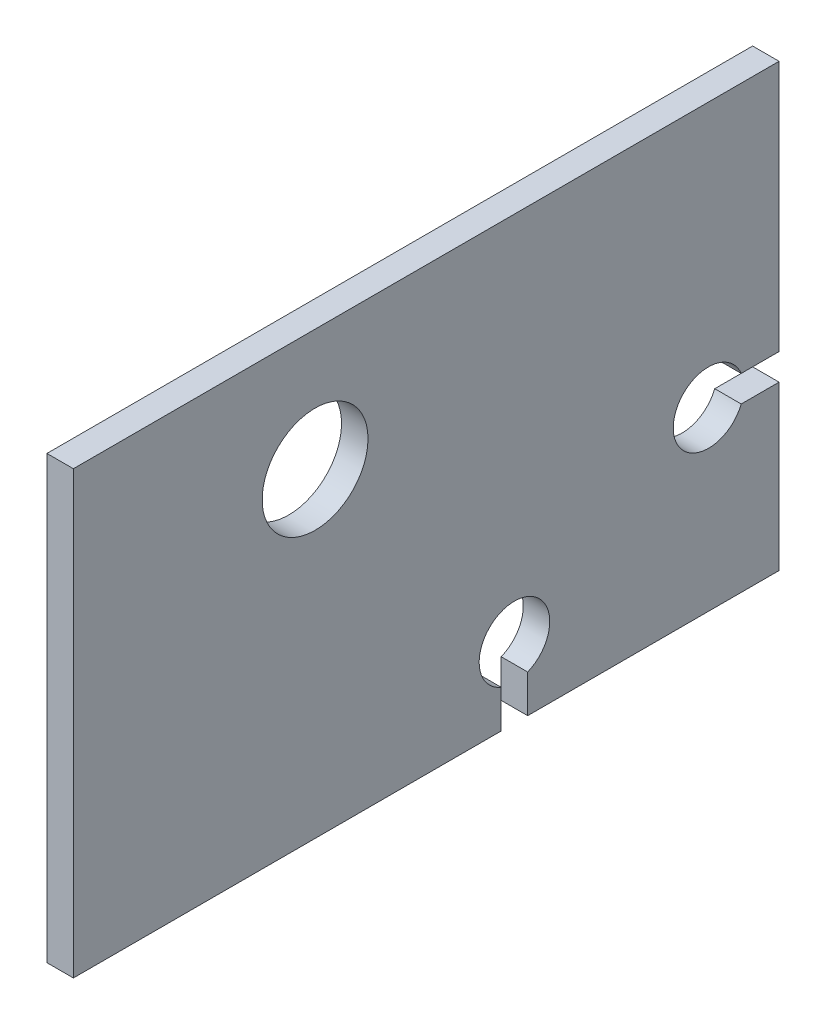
ISO-10303-21;
HEADER;
FILE_DESCRIPTION(('STEP AP214'),'2;1');
FILE_NAME('part.step','',(''),(''),'','','');
FILE_SCHEMA(('AUTOMOTIVE_DESIGN { 1 0 10303 214 1 1 1 1 }'));
ENDSEC;
DATA;
#1=APPLICATION_CONTEXT('core data for automotive mechanical design processes');
#2=APPLICATION_PROTOCOL_DEFINITION('international standard','automotive_design',2000,#1);
#3=PRODUCT_CONTEXT('',#1,'mechanical');
#4=PRODUCT('Part','Part','',(#3));
#5=PRODUCT_RELATED_PRODUCT_CATEGORY('part','',(#4));
#6=PRODUCT_DEFINITION_FORMATION('','',#4);
#7=PRODUCT_DEFINITION_CONTEXT('part definition',#1,'design');
#8=PRODUCT_DEFINITION('design','',#6,#7);
#9=PRODUCT_DEFINITION_SHAPE('','',#8);
#10=(LENGTH_UNIT() NAMED_UNIT(*) SI_UNIT(.MILLI.,.METRE.));
#11=(NAMED_UNIT(*) PLANE_ANGLE_UNIT() SI_UNIT($,.RADIAN.));
#12=(NAMED_UNIT(*) SI_UNIT($,.STERADIAN.) SOLID_ANGLE_UNIT());
#13=UNCERTAINTY_MEASURE_WITH_UNIT(LENGTH_MEASURE(1.E-05),#10,'distance_accuracy_value','');
#14=(GEOMETRIC_REPRESENTATION_CONTEXT(3) GLOBAL_UNCERTAINTY_ASSIGNED_CONTEXT((#13)) GLOBAL_UNIT_ASSIGNED_CONTEXT((#10,
#11,#12)) REPRESENTATION_CONTEXT('',''));
#15=CARTESIAN_POINT('',(0.,0.,0.));
#16=DIRECTION('',(0.,0.,1.));
#17=DIRECTION('',(1.,0.,0.));
#18=AXIS2_PLACEMENT_3D('',#15,#16,#17);
#19=CARTESIAN_POINT('',(1.5,20.,-72.));
#20=DIRECTION('',(1.,0.,0.));
#21=DIRECTION('',(0.,0.,-1.));
#22=AXIS2_PLACEMENT_3D('',#19,#20,#21);
#23=PLANE('',#22);
#24=DIRECTION('',(0.,-1.,0.));
#25=VECTOR('',#24,1.);
#26=CARTESIAN_POINT('',(1.5,0.,0.));
#27=LINE('',#26,#25);
#28=CARTESIAN_POINT('',(1.5,50.,0.));
#29=VERTEX_POINT('',#28);
#30=CARTESIAN_POINT('',(1.5,0.,0.));
#31=VERTEX_POINT('',#30);
#32=EDGE_CURVE('E165',#29,#31,#27,.T.);
#33=ORIENTED_EDGE('',*,*,#32,.T.);
#34=DIRECTION('',(0.,0.,-1.));
#35=VECTOR('',#34,1.);
#36=CARTESIAN_POINT('',(1.5,0.,0.));
#37=LINE('',#36,#35);
#38=CARTESIAN_POINT('',(1.5,0.,-48.5));
#39=VERTEX_POINT('',#38);
#40=EDGE_CURVE('E134',#31,#39,#37,.T.);
#41=ORIENTED_EDGE('',*,*,#40,.T.);
#42=DIRECTION('',(0.,1.,0.));
#43=VECTOR('',#42,1.);
#44=CARTESIAN_POINT('',(1.5,4.29190075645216,-48.5));
#45=LINE('',#44,#43);
#46=CARTESIAN_POINT('',(1.5,4.29190075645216,-48.5));
#47=VERTEX_POINT('',#46);
#48=EDGE_CURVE('E168',#39,#47,#45,.T.);
#49=ORIENTED_EDGE('',*,*,#48,.T.);
#50=CARTESIAN_POINT('',(1.5,7.99999999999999,-50.));
#51=DIRECTION('',(-1.,0.,0.));
#52=DIRECTION('',(0.,0.,-1.));
#53=AXIS2_PLACEMENT_3D('',#50,#51,#52);
#54=CIRCLE('',#53,4.);
#55=CARTESIAN_POINT('',(1.5,4.29190075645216,-51.5));
#56=VERTEX_POINT('',#55);
#57=EDGE_CURVE('E170',#47,#56,#54,.T.);
#58=ORIENTED_EDGE('',*,*,#57,.T.);
#59=DIRECTION('',(0.,-1.,0.));
#60=VECTOR('',#59,1.);
#61=CARTESIAN_POINT('',(1.5,4.29190075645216,-51.5));
#62=LINE('',#61,#60);
#63=CARTESIAN_POINT('',(1.5,0.,-51.5));
#64=VERTEX_POINT('',#63);
#65=EDGE_CURVE('E172',#56,#64,#62,.T.);
#66=ORIENTED_EDGE('',*,*,#65,.T.);
#67=DIRECTION('',(0.,0.,-1.));
#68=VECTOR('',#67,1.);
#69=CARTESIAN_POINT('',(1.5,0.,-51.5));
#70=LINE('',#69,#68);
#71=CARTESIAN_POINT('',(1.5,0.,-80.));
#72=VERTEX_POINT('',#71);
#73=EDGE_CURVE('E174',#64,#72,#70,.T.);
#74=ORIENTED_EDGE('',*,*,#73,.T.);
#75=DIRECTION('',(0.,1.,0.));
#76=VECTOR('',#75,1.);
#77=CARTESIAN_POINT('',(1.5,0.,-80.));
#78=LINE('',#77,#76);
#79=CARTESIAN_POINT('',(1.5,18.5,-80.));
#80=VERTEX_POINT('',#79);
#81=EDGE_CURVE('E176',#72,#80,#78,.T.);
#82=ORIENTED_EDGE('',*,*,#81,.T.);
#83=DIRECTION('',(0.,0.,1.));
#84=VECTOR('',#83,1.);
#85=CARTESIAN_POINT('',(1.5,18.5,-75.7080992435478));
#86=LINE('',#85,#84);
#87=CARTESIAN_POINT('',(1.5,18.5,-75.7080992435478));
#88=VERTEX_POINT('',#87);
#89=EDGE_CURVE('E178',#80,#88,#86,.T.);
#90=ORIENTED_EDGE('',*,*,#89,.T.);
#91=CARTESIAN_POINT('',(1.5,20.,-72.));
#92=DIRECTION('',(-1.,0.,0.));
#93=DIRECTION('',(0.,0.,-1.));
#94=AXIS2_PLACEMENT_3D('',#91,#92,#93);
#95=CIRCLE('',#94,4.);
#96=CARTESIAN_POINT('',(1.5,21.5,-75.7080992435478));
#97=VERTEX_POINT('',#96);
#98=EDGE_CURVE('E180',#88,#97,#95,.T.);
#99=ORIENTED_EDGE('',*,*,#98,.T.);
#100=DIRECTION('',(0.,0.,-1.));
#101=VECTOR('',#100,1.);
#102=CARTESIAN_POINT('',(1.5,21.5,-75.7080992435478));
#103=LINE('',#102,#101);
#104=CARTESIAN_POINT('',(1.5,21.5,-80.));
#105=VERTEX_POINT('',#104);
#106=EDGE_CURVE('E182',#97,#105,#103,.T.);
#107=ORIENTED_EDGE('',*,*,#106,.T.);
#108=DIRECTION('',(0.,1.,0.));
#109=VECTOR('',#108,1.);
#110=CARTESIAN_POINT('',(1.5,21.5,-80.));
#111=LINE('',#110,#109);
#112=CARTESIAN_POINT('',(1.5,50.,-80.));
#113=VERTEX_POINT('',#112);
#114=EDGE_CURVE('E51',#105,#113,#111,.T.);
#115=ORIENTED_EDGE('',*,*,#114,.T.);
#116=DIRECTION('',(0.,0.,1.));
#117=VECTOR('',#116,1.);
#118=CARTESIAN_POINT('',(1.5,50.,0.));
#119=LINE('',#118,#117);
#120=EDGE_CURVE('E46',#113,#29,#119,.T.);
#121=ORIENTED_EDGE('',*,*,#120,.T.);
#122=EDGE_LOOP('',(#33,#41,#49,#58,#66,#74,#82,#90,#99,#107,#115,#121));
#123=FACE_BOUND('',#122,.T.);
#124=CARTESIAN_POINT('',(1.5,36.25,-27.4));
#125=DIRECTION('',(1.,0.,0.));
#126=DIRECTION('',(0.,0.,-1.));
#127=AXIS2_PLACEMENT_3D('',#124,#125,#126);
#128=CIRCLE('',#127,6.);
#129=CARTESIAN_POINT('',(1.5,36.25,-33.4));
#130=VERTEX_POINT('',#129);
#131=EDGE_CURVE('E139',#130,#130,#128,.T.);
#132=ORIENTED_EDGE('',*,*,#131,.F.);
#133=EDGE_LOOP('',(#132));
#134=FACE_BOUND('',#133,.T.);
#135=ADVANCED_FACE('F31',(#123,#134),#23,.T.);
#136=CARTESIAN_POINT('',(-1.5,20.,-72.));
#137=DIRECTION('',(1.,0.,0.));
#138=DIRECTION('',(0.,0.,-1.));
#139=AXIS2_PLACEMENT_3D('',#136,#137,#138);
#140=PLANE('',#139);
#141=DIRECTION('',(0.,-1.,0.));
#142=VECTOR('',#141,1.);
#143=CARTESIAN_POINT('',(-1.5,0.,0.));
#144=LINE('',#143,#142);
#145=CARTESIAN_POINT('',(-1.5,50.,0.));
#146=VERTEX_POINT('',#145);
#147=CARTESIAN_POINT('',(-1.5,0.,0.));
#148=VERTEX_POINT('',#147);
#149=EDGE_CURVE('E125',#146,#148,#144,.T.);
#150=ORIENTED_EDGE('',*,*,#149,.F.);
#151=DIRECTION('',(0.,0.,1.));
#152=VECTOR('',#151,1.);
#153=CARTESIAN_POINT('',(-1.5,50.,0.));
#154=LINE('',#153,#152);
#155=CARTESIAN_POINT('',(-1.5,50.,-80.));
#156=VERTEX_POINT('',#155);
#157=EDGE_CURVE('E163',#156,#146,#154,.T.);
#158=ORIENTED_EDGE('',*,*,#157,.F.);
#159=DIRECTION('',(0.,1.,0.));
#160=VECTOR('',#159,1.);
#161=CARTESIAN_POINT('',(-1.5,21.5,-80.));
#162=LINE('',#161,#160);
#163=CARTESIAN_POINT('',(-1.5,21.5,-80.));
#164=VERTEX_POINT('',#163);
#165=EDGE_CURVE('E161',#164,#156,#162,.T.);
#166=ORIENTED_EDGE('',*,*,#165,.F.);
#167=DIRECTION('',(0.,0.,-1.));
#168=VECTOR('',#167,1.);
#169=CARTESIAN_POINT('',(-1.5,21.5,-75.7080992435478));
#170=LINE('',#169,#168);
#171=CARTESIAN_POINT('',(-1.5,21.5,-75.7080992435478));
#172=VERTEX_POINT('',#171);
#173=EDGE_CURVE('E159',#172,#164,#170,.T.);
#174=ORIENTED_EDGE('',*,*,#173,.F.);
#175=CARTESIAN_POINT('',(-1.5,20.,-72.));
#176=DIRECTION('',(-1.,0.,0.));
#177=DIRECTION('',(0.,0.,-1.));
#178=AXIS2_PLACEMENT_3D('',#175,#176,#177);
#179=CIRCLE('',#178,4.);
#180=CARTESIAN_POINT('',(-1.5,18.5,-75.7080992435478));
#181=VERTEX_POINT('',#180);
#182=EDGE_CURVE('E157',#181,#172,#179,.T.);
#183=ORIENTED_EDGE('',*,*,#182,.F.);
#184=DIRECTION('',(0.,0.,1.));
#185=VECTOR('',#184,1.);
#186=CARTESIAN_POINT('',(-1.5,18.5,-75.7080992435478));
#187=LINE('',#186,#185);
#188=CARTESIAN_POINT('',(-1.5,18.5,-80.));
#189=VERTEX_POINT('',#188);
#190=EDGE_CURVE('E155',#189,#181,#187,.T.);
#191=ORIENTED_EDGE('',*,*,#190,.F.);
#192=DIRECTION('',(0.,1.,0.));
#193=VECTOR('',#192,1.);
#194=CARTESIAN_POINT('',(-1.5,0.,-80.));
#195=LINE('',#194,#193);
#196=CARTESIAN_POINT('',(-1.5,0.,-80.));
#197=VERTEX_POINT('',#196);
#198=EDGE_CURVE('E153',#197,#189,#195,.T.);
#199=ORIENTED_EDGE('',*,*,#198,.F.);
#200=DIRECTION('',(0.,0.,-1.));
#201=VECTOR('',#200,1.);
#202=CARTESIAN_POINT('',(-1.5,0.,-51.5));
#203=LINE('',#202,#201);
#204=CARTESIAN_POINT('',(-1.5,0.,-51.5));
#205=VERTEX_POINT('',#204);
#206=EDGE_CURVE('E151',#205,#197,#203,.T.);
#207=ORIENTED_EDGE('',*,*,#206,.F.);
#208=DIRECTION('',(0.,-1.,0.));
#209=VECTOR('',#208,1.);
#210=CARTESIAN_POINT('',(-1.5,4.29190075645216,-51.5));
#211=LINE('',#210,#209);
#212=CARTESIAN_POINT('',(-1.5,4.29190075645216,-51.5));
#213=VERTEX_POINT('',#212);
#214=EDGE_CURVE('E149',#213,#205,#211,.T.);
#215=ORIENTED_EDGE('',*,*,#214,.F.);
#216=CARTESIAN_POINT('',(-1.5,7.99999999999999,-50.));
#217=DIRECTION('',(-1.,0.,0.));
#218=DIRECTION('',(0.,0.,-1.));
#219=AXIS2_PLACEMENT_3D('',#216,#217,#218);
#220=CIRCLE('',#219,4.);
#221=CARTESIAN_POINT('',(-1.5,4.29190075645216,-48.5));
#222=VERTEX_POINT('',#221);
#223=EDGE_CURVE('E147',#222,#213,#220,.T.);
#224=ORIENTED_EDGE('',*,*,#223,.F.);
#225=DIRECTION('',(0.,1.,0.));
#226=VECTOR('',#225,1.);
#227=CARTESIAN_POINT('',(-1.5,4.29190075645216,-48.5));
#228=LINE('',#227,#226);
#229=CARTESIAN_POINT('',(-1.5,0.,-48.5));
#230=VERTEX_POINT('',#229);
#231=EDGE_CURVE('E127',#230,#222,#228,.T.);
#232=ORIENTED_EDGE('',*,*,#231,.F.);
#233=DIRECTION('',(0.,0.,-1.));
#234=VECTOR('',#233,1.);
#235=CARTESIAN_POINT('',(-1.5,0.,0.));
#236=LINE('',#235,#234);
#237=EDGE_CURVE('E120',#148,#230,#236,.T.);
#238=ORIENTED_EDGE('',*,*,#237,.F.);
#239=EDGE_LOOP('',(#150,#158,#166,#174,#183,#191,#199,#207,#215,#224,#232,#238));
#240=FACE_BOUND('',#239,.T.);
#241=CARTESIAN_POINT('',(-1.5,36.25,-27.4));
#242=DIRECTION('',(1.,0.,0.));
#243=DIRECTION('',(0.,0.,-1.));
#244=AXIS2_PLACEMENT_3D('',#241,#242,#243);
#245=CIRCLE('',#244,6.);
#246=CARTESIAN_POINT('',(-1.5,36.25,-33.4));
#247=VERTEX_POINT('',#246);
#248=EDGE_CURVE('E142',#247,#247,#245,.T.);
#249=ORIENTED_EDGE('',*,*,#248,.T.);
#250=EDGE_LOOP('',(#249));
#251=FACE_BOUND('',#250,.T.);
#252=ADVANCED_FACE('F121',(#240,#251),#140,.F.);
#253=CARTESIAN_POINT('',(1.5,0.,0.));
#254=DIRECTION('',(0.,0.,-1.));
#255=DIRECTION('',(-1.,0.,0.));
#256=AXIS2_PLACEMENT_3D('',#253,#254,#255);
#257=PLANE('',#256);
#258=ORIENTED_EDGE('',*,*,#149,.T.);
#259=DIRECTION('',(-1.,0.,0.));
#260=VECTOR('',#259,1.);
#261=CARTESIAN_POINT('',(1.5,0.,0.));
#262=LINE('',#261,#260);
#263=EDGE_CURVE('E11',#31,#148,#262,.T.);
#264=ORIENTED_EDGE('',*,*,#263,.F.);
#265=ORIENTED_EDGE('',*,*,#32,.F.);
#266=DIRECTION('',(-1.,0.,0.));
#267=VECTOR('',#266,1.);
#268=CARTESIAN_POINT('',(1.5,50.,0.));
#269=LINE('',#268,#267);
#270=EDGE_CURVE('E138',#29,#146,#269,.T.);
#271=ORIENTED_EDGE('',*,*,#270,.T.);
#272=EDGE_LOOP('',(#258,#264,#265,#271));
#273=FACE_BOUND('',#272,.T.);
#274=ADVANCED_FACE('F33',(#273),#257,.F.);
#275=CARTESIAN_POINT('',(1.5,0.,0.));
#276=DIRECTION('',(0.,1.,0.));
#277=DIRECTION('',(0.,0.,1.));
#278=AXIS2_PLACEMENT_3D('',#275,#276,#277);
#279=PLANE('',#278);
#280=ORIENTED_EDGE('',*,*,#237,.T.);
#281=DIRECTION('',(-1.,0.,0.));
#282=VECTOR('',#281,1.);
#283=CARTESIAN_POINT('',(1.5,0.,-48.5));
#284=LINE('',#283,#282);
#285=EDGE_CURVE('E39',#39,#230,#284,.T.);
#286=ORIENTED_EDGE('',*,*,#285,.F.);
#287=ORIENTED_EDGE('',*,*,#40,.F.);
#288=ORIENTED_EDGE('',*,*,#263,.T.);
#289=EDGE_LOOP('',(#280,#286,#287,#288));
#290=FACE_BOUND('',#289,.T.);
#291=ADVANCED_FACE('F133',(#290),#279,.F.);
#292=CARTESIAN_POINT('',(1.5,4.29190075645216,-48.5));
#293=DIRECTION('',(0.,0.,1.));
#294=DIRECTION('',(1.,0.,0.));
#295=AXIS2_PLACEMENT_3D('',#292,#293,#294);
#296=PLANE('',#295);
#297=ORIENTED_EDGE('',*,*,#231,.T.);
#298=DIRECTION('',(-1.,0.,0.));
#299=VECTOR('',#298,1.);
#300=CARTESIAN_POINT('',(1.5,4.29190075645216,-48.5));
#301=LINE('',#300,#299);
#302=EDGE_CURVE('E211',#47,#222,#301,.T.);
#303=ORIENTED_EDGE('',*,*,#302,.F.);
#304=ORIENTED_EDGE('',*,*,#48,.F.);
#305=ORIENTED_EDGE('',*,*,#285,.T.);
#306=EDGE_LOOP('',(#297,#303,#304,#305));
#307=FACE_BOUND('',#306,.T.);
#308=ADVANCED_FACE('F215',(#307),#296,.F.);
#309=CARTESIAN_POINT('',(1.5,7.99999999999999,-50.));
#310=DIRECTION('',(-1.,0.,0.));
#311=DIRECTION('',(0.,0.,1.));
#312=AXIS2_PLACEMENT_3D('',#309,#310,#311);
#313=CYLINDRICAL_SURFACE('',#312,4.);
#314=ORIENTED_EDGE('',*,*,#223,.T.);
#315=DIRECTION('',(-1.,0.,0.));
#316=VECTOR('',#315,1.);
#317=CARTESIAN_POINT('',(1.5,4.29190075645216,-51.5));
#318=LINE('',#317,#316);
#319=EDGE_CURVE('E208',#56,#213,#318,.T.);
#320=ORIENTED_EDGE('',*,*,#319,.F.);
#321=ORIENTED_EDGE('',*,*,#57,.F.);
#322=ORIENTED_EDGE('',*,*,#302,.T.);
#323=EDGE_LOOP('',(#314,#320,#321,#322));
#324=FACE_BOUND('',#323,.T.);
#325=ADVANCED_FACE('F223',(#324),#313,.F.);
#326=CARTESIAN_POINT('',(1.5,4.29190075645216,-51.5));
#327=DIRECTION('',(0.,0.,-1.));
#328=DIRECTION('',(-1.,0.,0.));
#329=AXIS2_PLACEMENT_3D('',#326,#327,#328);
#330=PLANE('',#329);
#331=ORIENTED_EDGE('',*,*,#214,.T.);
#332=DIRECTION('',(-1.,0.,0.));
#333=VECTOR('',#332,1.);
#334=CARTESIAN_POINT('',(1.5,0.,-51.5));
#335=LINE('',#334,#333);
#336=EDGE_CURVE('E205',#64,#205,#335,.T.);
#337=ORIENTED_EDGE('',*,*,#336,.F.);
#338=ORIENTED_EDGE('',*,*,#65,.F.);
#339=ORIENTED_EDGE('',*,*,#319,.T.);
#340=EDGE_LOOP('',(#331,#337,#338,#339));
#341=FACE_BOUND('',#340,.T.);
#342=ADVANCED_FACE('F226',(#341),#330,.F.);
#343=CARTESIAN_POINT('',(1.5,0.,-51.5));
#344=DIRECTION('',(0.,1.,0.));
#345=DIRECTION('',(0.,0.,1.));
#346=AXIS2_PLACEMENT_3D('',#343,#344,#345);
#347=PLANE('',#346);
#348=ORIENTED_EDGE('',*,*,#206,.T.);
#349=DIRECTION('',(-1.,0.,0.));
#350=VECTOR('',#349,1.);
#351=CARTESIAN_POINT('',(1.5,0.,-80.));
#352=LINE('',#351,#350);
#353=EDGE_CURVE('E202',#72,#197,#352,.T.);
#354=ORIENTED_EDGE('',*,*,#353,.F.);
#355=ORIENTED_EDGE('',*,*,#73,.F.);
#356=ORIENTED_EDGE('',*,*,#336,.T.);
#357=EDGE_LOOP('',(#348,#354,#355,#356));
#358=FACE_BOUND('',#357,.T.);
#359=ADVANCED_FACE('F231',(#358),#347,.F.);
#360=CARTESIAN_POINT('',(1.5,0.,-80.));
#361=DIRECTION('',(0.,0.,1.));
#362=DIRECTION('',(1.,0.,0.));
#363=AXIS2_PLACEMENT_3D('',#360,#361,#362);
#364=PLANE('',#363);
#365=ORIENTED_EDGE('',*,*,#198,.T.);
#366=DIRECTION('',(-1.,0.,0.));
#367=VECTOR('',#366,1.);
#368=CARTESIAN_POINT('',(1.5,18.5,-80.));
#369=LINE('',#368,#367);
#370=EDGE_CURVE('E199',#80,#189,#369,.T.);
#371=ORIENTED_EDGE('',*,*,#370,.F.);
#372=ORIENTED_EDGE('',*,*,#81,.F.);
#373=ORIENTED_EDGE('',*,*,#353,.T.);
#374=EDGE_LOOP('',(#365,#371,#372,#373));
#375=FACE_BOUND('',#374,.T.);
#376=ADVANCED_FACE('F237',(#375),#364,.F.);
#377=CARTESIAN_POINT('',(1.5,18.5,-75.7080992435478));
#378=DIRECTION('',(0.,-1.,0.));
#379=DIRECTION('',(0.,0.,-1.));
#380=AXIS2_PLACEMENT_3D('',#377,#378,#379);
#381=PLANE('',#380);
#382=ORIENTED_EDGE('',*,*,#190,.T.);
#383=DIRECTION('',(-1.,0.,0.));
#384=VECTOR('',#383,1.);
#385=CARTESIAN_POINT('',(1.5,18.5,-75.7080992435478));
#386=LINE('',#385,#384);
#387=EDGE_CURVE('E196',#88,#181,#386,.T.);
#388=ORIENTED_EDGE('',*,*,#387,.F.);
#389=ORIENTED_EDGE('',*,*,#89,.F.);
#390=ORIENTED_EDGE('',*,*,#370,.T.);
#391=EDGE_LOOP('',(#382,#388,#389,#390));
#392=FACE_BOUND('',#391,.T.);
#393=ADVANCED_FACE('F241',(#392),#381,.F.);
#394=CARTESIAN_POINT('',(1.5,20.,-72.));
#395=DIRECTION('',(-1.,0.,0.));
#396=DIRECTION('',(0.,0.,1.));
#397=AXIS2_PLACEMENT_3D('',#394,#395,#396);
#398=CYLINDRICAL_SURFACE('',#397,4.);
#399=ORIENTED_EDGE('',*,*,#182,.T.);
#400=DIRECTION('',(-1.,0.,0.));
#401=VECTOR('',#400,1.);
#402=CARTESIAN_POINT('',(1.5,21.5,-75.7080992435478));
#403=LINE('',#402,#401);
#404=EDGE_CURVE('E193',#97,#172,#403,.T.);
#405=ORIENTED_EDGE('',*,*,#404,.F.);
#406=ORIENTED_EDGE('',*,*,#98,.F.);
#407=ORIENTED_EDGE('',*,*,#387,.T.);
#408=EDGE_LOOP('',(#399,#405,#406,#407));
#409=FACE_BOUND('',#408,.T.);
#410=ADVANCED_FACE('F246',(#409),#398,.F.);
#411=CARTESIAN_POINT('',(1.5,21.5,-75.7080992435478));
#412=DIRECTION('',(0.,1.,0.));
#413=DIRECTION('',(0.,0.,1.));
#414=AXIS2_PLACEMENT_3D('',#411,#412,#413);
#415=PLANE('',#414);
#416=ORIENTED_EDGE('',*,*,#173,.T.);
#417=DIRECTION('',(-1.,0.,0.));
#418=VECTOR('',#417,1.);
#419=CARTESIAN_POINT('',(1.5,21.5,-80.));
#420=LINE('',#419,#418);
#421=EDGE_CURVE('E190',#105,#164,#420,.T.);
#422=ORIENTED_EDGE('',*,*,#421,.F.);
#423=ORIENTED_EDGE('',*,*,#106,.F.);
#424=ORIENTED_EDGE('',*,*,#404,.T.);
#425=EDGE_LOOP('',(#416,#422,#423,#424));
#426=FACE_BOUND('',#425,.T.);
#427=ADVANCED_FACE('F250',(#426),#415,.F.);
#428=CARTESIAN_POINT('',(1.5,21.5,-80.));
#429=DIRECTION('',(0.,0.,1.));
#430=DIRECTION('',(1.,0.,0.));
#431=AXIS2_PLACEMENT_3D('',#428,#429,#430);
#432=PLANE('',#431);
#433=ORIENTED_EDGE('',*,*,#165,.T.);
#434=DIRECTION('',(-1.,0.,0.));
#435=VECTOR('',#434,1.);
#436=CARTESIAN_POINT('',(1.5,50.,-80.));
#437=LINE('',#436,#435);
#438=EDGE_CURVE('E187',#113,#156,#437,.T.);
#439=ORIENTED_EDGE('',*,*,#438,.F.);
#440=ORIENTED_EDGE('',*,*,#114,.F.);
#441=ORIENTED_EDGE('',*,*,#421,.T.);
#442=EDGE_LOOP('',(#433,#439,#440,#441));
#443=FACE_BOUND('',#442,.T.);
#444=ADVANCED_FACE('F254',(#443),#432,.F.);
#445=CARTESIAN_POINT('',(1.5,50.,0.));
#446=DIRECTION('',(0.,-1.,0.));
#447=DIRECTION('',(0.,0.,-1.));
#448=AXIS2_PLACEMENT_3D('',#445,#446,#447);
#449=PLANE('',#448);
#450=ORIENTED_EDGE('',*,*,#157,.T.);
#451=ORIENTED_EDGE('',*,*,#270,.F.);
#452=ORIENTED_EDGE('',*,*,#120,.F.);
#453=ORIENTED_EDGE('',*,*,#438,.T.);
#454=EDGE_LOOP('',(#450,#451,#452,#453));
#455=FACE_BOUND('',#454,.T.);
#456=ADVANCED_FACE('F256',(#455),#449,.F.);
#457=CARTESIAN_POINT('',(1.5,36.25,-27.4));
#458=DIRECTION('',(-1.,0.,0.));
#459=DIRECTION('',(0.,0.,1.));
#460=AXIS2_PLACEMENT_3D('',#457,#458,#459);
#461=CYLINDRICAL_SURFACE('',#460,6.);
#462=ORIENTED_EDGE('',*,*,#131,.T.);
#463=EDGE_LOOP('',(#462));
#464=FACE_BOUND('',#463,.T.);
#465=ORIENTED_EDGE('',*,*,#248,.F.);
#466=EDGE_LOOP('',(#465));
#467=FACE_BOUND('',#466,.T.);
#468=ADVANCED_FACE('F258',(#464,#467),#461,.F.);
#469=CLOSED_SHELL('',(#135,#252,#274,#291,#308,#325,#342,#359,#376,#393,#410,#427,#444,#456,#468));
#470=MANIFOLD_SOLID_BREP('B2',#469);
#471=ADVANCED_BREP_SHAPE_REPRESENTATION('',(#18,#470),#14);
#472=SHAPE_DEFINITION_REPRESENTATION(#9,#471);
ENDSEC;
END-ISO-10303-21;
